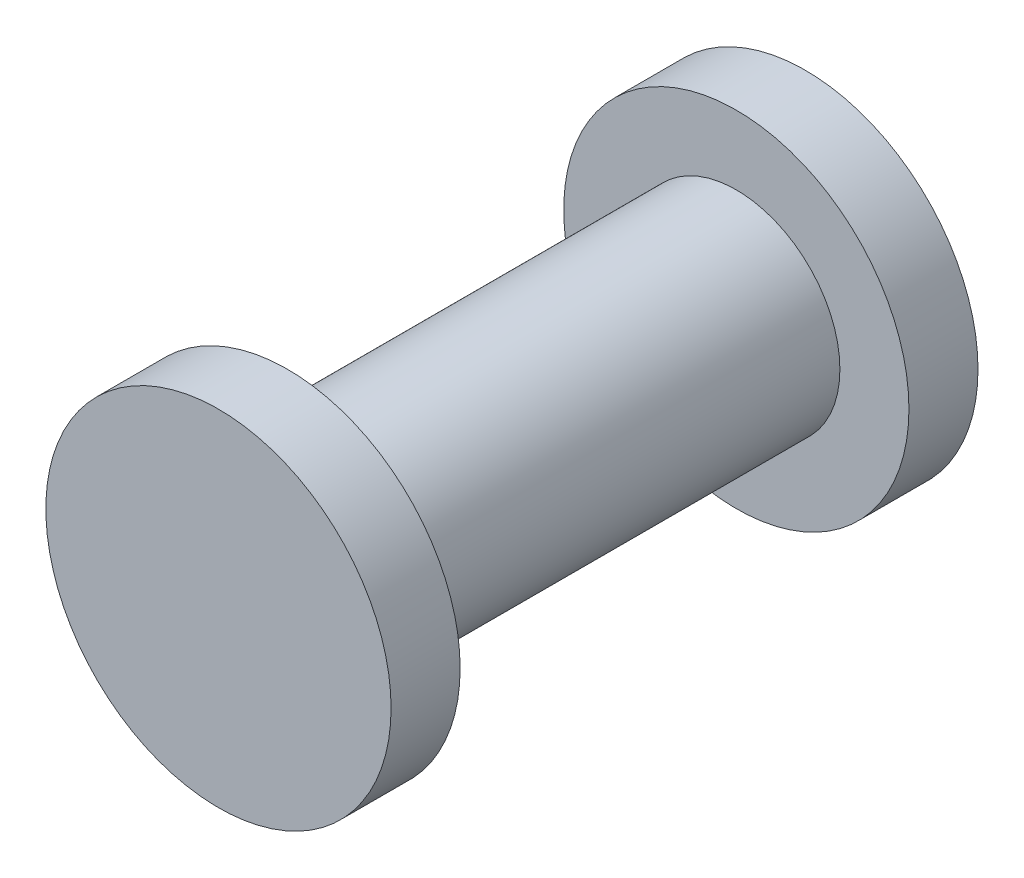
from build123d import *

# Parameters (mm, degrees)
SKETCH_1_R                 = 5
RETAINED_PIN_D6_DEPTH      = 8.5
SKETCH_2_R                 = 5.1
SKETCH_2_R_2               = 3
SHAFT_D6_ENDCAPS_D10_DEPTH = 6.5


with BuildPart() as part:
    # Sketch 1 → Retained_Pin_D6 (new, symmetric)
    with BuildSketch(Plane.XY):
        Circle(SKETCH_1_R)
    extrude(amount=RETAINED_PIN_D6_DEPTH, both=True)

    # Sketch 2 → Shaft_D6_EndCaps_D10 (cut, symmetric)
    with BuildSketch(Plane.XY):
        Circle(SKETCH_2_R)
        Circle(SKETCH_2_R_2, mode=Mode.SUBTRACT)
    extrude(amount=SHAFT_D6_ENDCAPS_D10_DEPTH, both=True, mode=Mode.SUBTRACT)


solid = part.part
